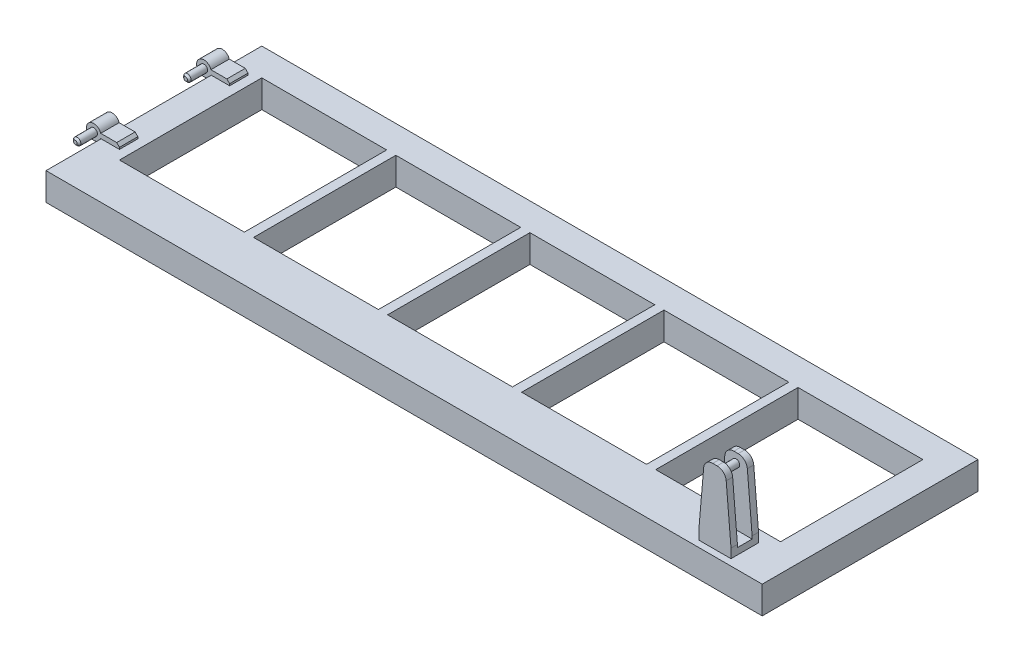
from build123d import *
from OCP.BRepFilletAPI import BRepFilletAPI_MakeChamfer

# Parameters (mm, degrees)
ESQUISSE1_W          = 30
ESQUISSE1_H          = 30
BASE_EXTRUSION_DEPTH = 235
ESQUISSE2_W          = 50
ESQUISSE2_H          = 30
ESQUISSE2_W_2        = 30
BOSS_EXTRU_1_DEPTH   = 720
ESQUISSE3_W          = 235
ESQUISSE3_H          = 30
BOSS_EXTRU_2_DEPTH   = 30
BOSS_EXTRU_3_START   = -205
ESQUISSE4_W          = 10
ESQUISSE4_H          = 30
BOSS_EXTRU_3_DEPTH   = 155
ESQUISSE5_W          = 28
ESQUISSE5_H          = 20
BOSS_EXTRU_4_DEPTH   = 5
ESQUISSE6_R          = 8
BOSS_EXTRU_5_DEPTH   = 20
ESQUISSE7_R          = 4
BOSS_EXTRU_6_DEPTH   = 20
CHANFREIN1_SIZE      = 2
ESQUISSE8_W          = 28
ESQUISSE8_H          = 20
BOSS_EXTRU_7_DEPTH   = 5
ESQUISSE9_R          = 8
BOSS_EXTRU_8_DEPTH   = 20
ESQUISSE10_R         = 4
BOSS_EXTRU_9_DEPTH   = 20
CHANFREIN2_SIZE      = 2
CHANFREIN3_SIZE      = 3
ESQUISSE11_W         = 35
ESQUISSE11_H         = 7
BOSS_EXTRU_10_DEPTH  = 80
CHANFREIN4_SIZE      = 70
CHANFREIN4_SIZE2     = 6
CONG_1_R             = 10
BOSS_EXTRU_11_START  = -23
ESQUISSE12_R         = 4
BOSS_EXTRU_11_DEPTH  = 16
ESQUISSE13_W         = 35
ESQUISSE13_H         = 16
BOSS_EXTRU_12_DEPTH  = 7


with BuildPart() as part:
    # Esquisse1 → Base-Extrusion (new body)
    with BuildSketch(Plane.XY):
        with Locations((15, 15)):
            Rectangle(ESQUISSE1_W, ESQUISSE1_H)
    extrude(amount=BASE_EXTRUSION_DEPTH)

    # Esquisse2 → Boss.-Extru.1 (add)
    with BuildSketch(Plane(origin=(30, 0, 0), x_dir=(0, 0, -1), z_dir=(1, 0, 0))):
        with Locations((-210, 15)):
            Rectangle(ESQUISSE2_W, ESQUISSE2_H)
        with Locations((-15, 15)):
            Rectangle(ESQUISSE2_W_2, ESQUISSE2_H)
    extrude(amount=BOSS_EXTRU_1_DEPTH)

    # Esquisse3 → Boss.-Extru.2 (add)
    with BuildSketch(Plane(origin=(750, 0, 0), x_dir=(0, 0, -1), z_dir=(1, 0, 0))):
        with Locations((-117.5, 15)):
            Rectangle(ESQUISSE3_W, ESQUISSE3_H)
    extrude(amount=BOSS_EXTRU_2_DEPTH)

    # Esquisse4 → Boss.-Extru.3 (add)
    with BuildSketch(Plane.XY.offset(235).offset(BOSS_EXTRU_3_START)):
        with Locations((171, 15)):
            Rectangle(ESQUISSE4_W, ESQUISSE4_H)
        with Locations((317, 15)):
            Rectangle(ESQUISSE4_W, ESQUISSE4_H)
        with Locations((609, 15)):
            Rectangle(ESQUISSE4_W, ESQUISSE4_H)
        with Locations((463, 15)):
            Rectangle(ESQUISSE4_W, ESQUISSE4_H)
    extrude(amount=BOSS_EXTRU_3_DEPTH)

    # Esquisse5 → Boss.-Extru.4 (add)
    with BuildSketch(Plane(origin=(0, 30, 0), x_dir=(-1, 0, 0), z_dir=(0, 1, 0))):
        with Locations((-6, 165)):
            Rectangle(ESQUISSE5_W, ESQUISSE5_H)
    extrude(amount=BOSS_EXTRU_4_DEPTH)

    # Esquisse6 → Boss.-Extru.5 (add)
    with BuildSketch(Plane.XY.offset(175)):
        with Locations((-8, 32.5)):
            Circle(ESQUISSE6_R)
    extrude(amount=-BOSS_EXTRU_5_DEPTH)

    # Esquisse7 → Boss.-Extru.6 (add)
    with BuildSketch(Plane.XY.offset(175)):
        with Locations(Location((-8, 32.5, 0), (0, 0, 180))):
            Circle(ESQUISSE7_R)
    extrude(amount=BOSS_EXTRU_6_DEPTH)

    # Chanfrein1
    chanfrein1_edges = [part.edges().sort_by_distance(p)[0] for p in [
        (-4, 32.5, 195),
    ]]
    chamfer(chanfrein1_edges, length=CHANFREIN1_SIZE)

    # Esquisse8 → Boss.-Extru.7 (add)
    with BuildSketch(Plane(origin=(5.897286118, 30, -103.754248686), x_dir=(-1, 0, 0), z_dir=(0, 1, 0))):
        with Locations((-0.102713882, 148.754248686)):
            Rectangle(ESQUISSE8_W, ESQUISSE8_H)
    extrude(amount=BOSS_EXTRU_7_DEPTH)

    # Esquisse9 → Boss.-Extru.8 (add)
    with BuildSketch(Plane(origin=(5.897286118, 0, 55), x_dir=(1, 0, 0), z_dir=(0, 0, 1))):
        with Locations((-13.897286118, 32.5)):
            Circle(ESQUISSE9_R)
    extrude(amount=-BOSS_EXTRU_8_DEPTH)

    # Esquisse10 → Boss.-Extru.9 (add)
    with BuildSketch(Plane(origin=(5.897286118, 0, 55), x_dir=(1, 0, 0), z_dir=(0, 0, 1))):
        with Locations(Location((-13.897286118, 32.5, 0), (0, 0, 179.999999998))):
            Circle(ESQUISSE10_R)
    extrude(amount=BOSS_EXTRU_9_DEPTH)

    # Chanfrein2
    chanfrein2_edges = [part.edges().sort_by_distance(p)[0] for p in [
        (-4, 32.5, 75),
    ]]
    chamfer(chanfrein2_edges, length=CHANFREIN2_SIZE)

    # Chanfrein3
    chanfrein3_edges = [part.edges().sort_by_distance(p)[0] for p in [
        (20, 35, 165),
        (20, 35, 45),
    ]]
    chamfer(chanfrein3_edges, length=CHANFREIN3_SIZE)

    # Esquisse11 → Boss.-Extru.10 (add)
    with BuildSketch(Plane(origin=(0, 30, 0), x_dir=(-1, 0, 0), z_dir=(0, 1, 0))):
        with Locations((-721.5, 201.5)):
            Rectangle(ESQUISSE11_W, ESQUISSE11_H)
        with Locations((-721.5, 224.5)):
            Rectangle(ESQUISSE11_W, ESQUISSE11_H)
    extrude(amount=BOSS_EXTRU_10_DEPTH)

    # Chanfrein4: one chamfer whose edges measure the first distance from different faces: ONE call of the kernel's chamfer builder (chamfer() names one face for all edges)
    chanfrein4_edges_1 = [part.edges().sort_by_distance(p)[0] for p in [
        (704, 110, 201.5),
    ]]
    chanfrein4_side_1 = [part.faces().sort_by_distance(p)[0] for p in [
        (704, 70, 201.5),
    ]]
    chanfrein4_edges_2 = [part.edges().sort_by_distance(p)[0] for p in [
        (739, 110, 201.5),
    ]]
    chanfrein4_side_2 = [part.faces().sort_by_distance(p)[0] for p in [
        (739, 70, 201.5),
    ]]
    chanfrein4_edges_3 = [part.edges().sort_by_distance(p)[0] for p in [
        (704, 110, 224.5),
    ]]
    chanfrein4_side_3 = [part.faces().sort_by_distance(p)[0] for p in [
        (704, 70, 224.5),
    ]]
    chanfrein4_edges_4 = [part.edges().sort_by_distance(p)[0] for p in [
        (739, 110, 224.5),
    ]]
    chanfrein4_side_4 = [part.faces().sort_by_distance(p)[0] for p in [
        (739, 70, 224.5),
    ]]
    chanfrein4 = BRepFilletAPI_MakeChamfer(part.part.solid().wrapped)
    for e in chanfrein4_edges_1:
        chanfrein4.Add(CHANFREIN4_SIZE, CHANFREIN4_SIZE2, e.wrapped, chanfrein4_side_1[0].wrapped)  # the first distance lies on this face
    for e in chanfrein4_edges_2:
        chanfrein4.Add(CHANFREIN4_SIZE, CHANFREIN4_SIZE2, e.wrapped, chanfrein4_side_2[0].wrapped)  # the first distance lies on this face
    for e in chanfrein4_edges_3:
        chanfrein4.Add(CHANFREIN4_SIZE, CHANFREIN4_SIZE2, e.wrapped, chanfrein4_side_3[0].wrapped)  # the first distance lies on this face
    for e in chanfrein4_edges_4:
        chanfrein4.Add(CHANFREIN4_SIZE, CHANFREIN4_SIZE2, e.wrapped, chanfrein4_side_4[0].wrapped)  # the first distance lies on this face
    add(Compound.cast(chanfrein4.Shape()), mode=Mode.REPLACE)

    # Cong_1
    cong_1_edges = [part.edges().sort_by_distance(p)[0] for p in [
        (710, 110, 201.5),
        (733, 110, 201.5),
        (710, 110, 224.5),
        (733, 110, 224.5),
    ]]
    fillet(cong_1_edges, radius=CONG_1_R)

    # Esquisse12 → Boss.-Extru.11 (add)
    with BuildSketch(Plane(origin=(0, 0, 198), x_dir=(-1, 0, 0), z_dir=(0, 0, -1)).offset(BOSS_EXTRU_11_START)):
        with Locations((-721.5, 100)):
            Circle(ESQUISSE12_R)
    extrude(amount=BOSS_EXTRU_11_DEPTH)

    # Esquisse13 → Boss.-Extru.12 (add)
    with BuildSketch(Plane(origin=(0, 30, 0), x_dir=(-1, 0, 0), z_dir=(0, 1, 0))):
        with Locations((-721.5, 213)):
            Rectangle(ESQUISSE13_W, ESQUISSE13_H)
    extrude(amount=BOSS_EXTRU_12_DEPTH)


solid = part.part
